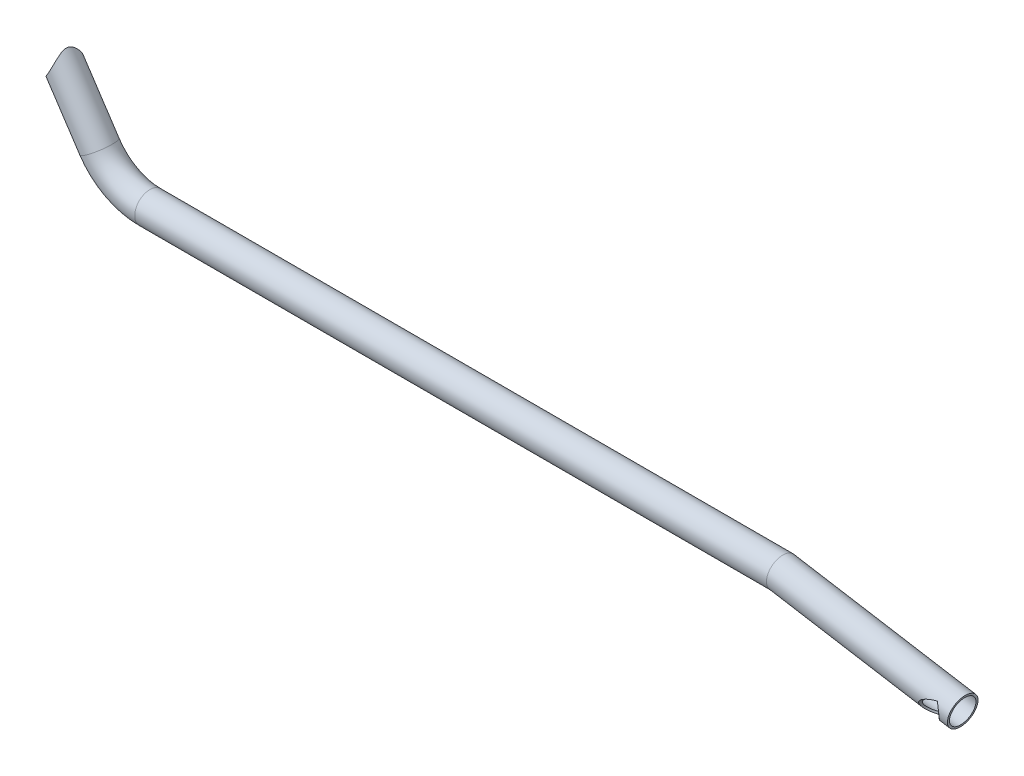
ISO-10303-21;
HEADER;
FILE_DESCRIPTION(('STEP AP214'),'2;1');
FILE_NAME('part.step','',(''),(''),'','','');
FILE_SCHEMA(('AUTOMOTIVE_DESIGN { 1 0 10303 214 1 1 1 1 }'));
ENDSEC;
DATA;
#1=APPLICATION_CONTEXT('core data for automotive mechanical design processes');
#2=APPLICATION_PROTOCOL_DEFINITION('international standard','automotive_design',2000,#1);
#3=PRODUCT_CONTEXT('',#1,'mechanical');
#4=PRODUCT('Part','Part','',(#3));
#5=PRODUCT_RELATED_PRODUCT_CATEGORY('part','',(#4));
#6=PRODUCT_DEFINITION_FORMATION('','',#4);
#7=PRODUCT_DEFINITION_CONTEXT('part definition',#1,'design');
#8=PRODUCT_DEFINITION('design','',#6,#7);
#9=PRODUCT_DEFINITION_SHAPE('','',#8);
#10=(LENGTH_UNIT() NAMED_UNIT(*) SI_UNIT(.MILLI.,.METRE.));
#11=(NAMED_UNIT(*) PLANE_ANGLE_UNIT() SI_UNIT($,.RADIAN.));
#12=(NAMED_UNIT(*) SI_UNIT($,.STERADIAN.) SOLID_ANGLE_UNIT());
#13=UNCERTAINTY_MEASURE_WITH_UNIT(LENGTH_MEASURE(1.E-05),#10,'distance_accuracy_value','');
#14=(GEOMETRIC_REPRESENTATION_CONTEXT(3) GLOBAL_UNCERTAINTY_ASSIGNED_CONTEXT((#13)) GLOBAL_UNIT_ASSIGNED_CONTEXT((#10,
#11,#12)) REPRESENTATION_CONTEXT('',''));
#15=CARTESIAN_POINT('',(0.,0.,0.));
#16=DIRECTION('',(0.,0.,1.));
#17=DIRECTION('',(1.,0.,0.));
#18=AXIS2_PLACEMENT_3D('',#15,#16,#17);
#19=CARTESIAN_POINT('',(-397.791987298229,-68.0982207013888,0.));
#20=DIRECTION('',(-0.551637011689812,0.834084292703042,0.));
#21=DIRECTION('',(-0.834084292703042,-0.551637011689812,0.));
#22=AXIS2_PLACEMENT_3D('',#19,#20,#21);
#23=CYLINDRICAL_SURFACE('',#22,15.);
#24=CARTESIAN_POINT('',(-443.212789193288,-26.613010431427,0.));
#25=CARTESIAN_POINT('',(-443.232089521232,-26.583828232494,0.422309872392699));
#26=CARTESIAN_POINT('',(-443.235515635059,-26.5462966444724,0.84476513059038));
#27=CARTESIAN_POINT('',(-443.211012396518,-26.4540593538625,1.68688016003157));
#28=CARTESIAN_POINT('',(-443.183083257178,-26.3993537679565,2.10653995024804));
#29=CARTESIAN_POINT('',(-443.096697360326,-26.2721403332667,2.93999809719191));
#30=CARTESIAN_POINT('',(-443.03823907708,-26.1996315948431,3.35379615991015));
#31=CARTESIAN_POINT('',(-442.892038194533,-26.0360750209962,4.17245998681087));
#32=CARTESIAN_POINT('',(-442.804295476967,-25.9450271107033,4.57732571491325));
#33=CARTESIAN_POINT('',(-442.601143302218,-25.7435793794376,5.37516655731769));
#34=CARTESIAN_POINT('',(-442.485731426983,-25.6331778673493,5.76814062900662));
#35=CARTESIAN_POINT('',(-442.229219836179,-25.3922127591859,6.53924675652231));
#36=CARTESIAN_POINT('',(-442.088120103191,-25.2616491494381,6.91737880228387));
#37=CARTESIAN_POINT('',(-441.782529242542,-24.979602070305,7.65596536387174));
#38=CARTESIAN_POINT('',(-441.618038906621,-24.8281193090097,8.01642047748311));
#39=CARTESIAN_POINT('',(-441.268241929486,-24.5035927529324,8.71695349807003));
#40=CARTESIAN_POINT('',(-441.082935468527,-24.3305491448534,9.05703158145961));
#41=CARTESIAN_POINT('',(-440.695392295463,-23.9634575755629,9.71246476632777));
#42=CARTESIAN_POINT('',(-440.493252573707,-23.7695282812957,10.0279436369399));
#43=CARTESIAN_POINT('',(-440.074192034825,-23.3597432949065,10.6338590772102));
#44=CARTESIAN_POINT('',(-439.857271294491,-23.143887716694,10.9242957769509));
#45=CARTESIAN_POINT('',(-439.411886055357,-22.6904805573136,11.4779481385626));
#46=CARTESIAN_POINT('',(-439.183424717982,-22.4529349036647,11.7411711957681));
#47=CARTESIAN_POINT('',(-438.718187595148,-21.9566462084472,12.2386908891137));
#48=CARTESIAN_POINT('',(-438.481412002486,-21.6979036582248,12.4729881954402));
#49=CARTESIAN_POINT('',(-438.009145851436,-21.1672387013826,12.9054859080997));
#50=CARTESIAN_POINT('',(-437.773785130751,-20.8958415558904,13.1044733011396));
#51=CARTESIAN_POINT('',(-437.301303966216,-20.3350693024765,13.4727882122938));
#52=CARTESIAN_POINT('',(-437.064183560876,-20.0456945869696,13.6421163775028));
#53=CARTESIAN_POINT('',(-436.591023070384,-19.4504956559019,13.9506354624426));
#54=CARTESIAN_POINT('',(-436.354982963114,-19.1446717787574,14.0898270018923));
#55=CARTESIAN_POINT('',(-435.886580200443,-18.5183308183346,14.3380313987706));
#56=CARTESIAN_POINT('',(-435.654217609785,-18.1978134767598,14.4470437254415));
#57=CARTESIAN_POINT('',(-435.193217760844,-17.5407909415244,14.6361682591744));
#58=CARTESIAN_POINT('',(-434.9646398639,-17.2041592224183,14.7159847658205));
#59=CARTESIAN_POINT('',(-434.515617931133,-16.519952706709,14.8459214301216));
#60=CARTESIAN_POINT('',(-434.295173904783,-16.1723778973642,14.8960415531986));
#61=CARTESIAN_POINT('',(-433.864015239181,-15.4682693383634,14.9676077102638));
#62=CARTESIAN_POINT('',(-433.65330297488,-15.1117334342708,14.9890467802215));
#63=CARTESIAN_POINT('',(-433.242939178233,-14.3917884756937,15.0044487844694));
#64=CARTESIAN_POINT('',(-433.043288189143,-14.0283790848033,14.998410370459));
#65=CARTESIAN_POINT('',(-432.636024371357,-13.2588776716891,14.9582233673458));
#66=CARTESIAN_POINT('',(-432.429710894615,-12.852246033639,14.9212424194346));
#67=CARTESIAN_POINT('',(-432.032506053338,-12.0353193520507,14.8173351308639));
#68=CARTESIAN_POINT('',(-431.84161563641,-11.6250240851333,14.7504069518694));
#69=CARTESIAN_POINT('',(-431.475636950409,-10.8028464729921,14.5884098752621));
#70=CARTESIAN_POINT('',(-431.300552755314,-10.39096374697,14.4933337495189));
#71=CARTESIAN_POINT('',(-430.966319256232,-9.56766764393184,14.2767434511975));
#72=CARTESIAN_POINT('',(-430.807172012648,-9.15625433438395,14.1552258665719));
#73=CARTESIAN_POINT('',(-430.477022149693,-8.26081288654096,13.8627973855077));
#74=CARTESIAN_POINT('',(-430.309161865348,-7.77724414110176,13.6869189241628));
#75=CARTESIAN_POINT('',(-429.994802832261,-6.81620385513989,13.3023722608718));
#76=CARTESIAN_POINT('',(-429.848307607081,-6.33873333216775,13.0936986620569));
#77=CARTESIAN_POINT('',(-429.575433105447,-5.39217532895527,12.6447699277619));
#78=CARTESIAN_POINT('',(-429.449080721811,-4.92309978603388,12.4044733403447));
#79=CARTESIAN_POINT('',(-429.215279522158,-3.99712157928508,11.8933409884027));
#80=CARTESIAN_POINT('',(-429.107827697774,-3.54021698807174,11.6225100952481));
#81=CARTESIAN_POINT('',(-428.921908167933,-2.69664778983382,11.0849294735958));
#82=CARTESIAN_POINT('',(-428.841505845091,-2.30818383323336,10.8216665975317));
#83=CARTESIAN_POINT('',(-428.692141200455,-1.54649211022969,10.2706884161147));
#84=CARTESIAN_POINT('',(-428.623181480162,-1.17326782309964,9.98296757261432));
#85=CARTESIAN_POINT('',(-428.494748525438,-0.447237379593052,9.38232407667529));
#86=CARTESIAN_POINT('',(-428.435255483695,-0.0943896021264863,9.06945616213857));
#87=CARTESIAN_POINT('',(-428.322846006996,0.585490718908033,8.41585406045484));
#88=CARTESIAN_POINT('',(-428.269924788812,0.912541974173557,8.07514044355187));
#89=CARTESIAN_POINT('',(-428.191618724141,1.38305358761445,7.53382293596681));
#90=CARTESIAN_POINT('',(-428.165208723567,1.53928913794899,7.34446081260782));
#91=CARTESIAN_POINT('',(-428.112476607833,1.84049114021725,6.95698596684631));
#92=CARTESIAN_POINT('',(-428.086154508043,1.98545571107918,6.75887179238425));
#93=CARTESIAN_POINT('',(-428.006267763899,2.40002108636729,6.15109157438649));
#94=CARTESIAN_POINT('',(-427.951687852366,2.64991094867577,5.72729854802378));
#95=CARTESIAN_POINT('',(-427.868329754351,2.94882129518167,5.10481683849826));
#96=CARTESIAN_POINT('',(-427.843285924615,3.02946992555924,4.92054057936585));
#97=CARTESIAN_POINT('',(-427.791235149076,3.17620803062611,4.54658049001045));
#98=CARTESIAN_POINT('',(-427.764229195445,3.24230479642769,4.35689942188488));
#99=CARTESIAN_POINT('',(-427.707952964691,3.35824638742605,3.97320923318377));
#100=CARTESIAN_POINT('',(-427.678685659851,3.40811211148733,3.77920602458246));
#101=CARTESIAN_POINT('',(-427.617667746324,3.49037431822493,3.38789201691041));
#102=CARTESIAN_POINT('',(-427.585917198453,3.5227712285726,3.19058129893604));
#103=CARTESIAN_POINT('',(-427.519789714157,3.56939639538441,2.79332184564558));
#104=CARTESIAN_POINT('',(-427.485401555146,3.58354186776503,2.59336521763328));
#105=CARTESIAN_POINT('',(-427.414341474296,3.59328379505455,2.19341705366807));
#106=CARTESIAN_POINT('',(-427.37766956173,3.58888032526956,1.99342551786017));
#107=CARTESIAN_POINT('',(-427.302400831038,3.56212495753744,1.59484775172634));
#108=CARTESIAN_POINT('',(-427.263802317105,3.5397569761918,1.39626294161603));
#109=CARTESIAN_POINT('',(-427.185200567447,3.47824429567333,1.00191975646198));
#110=CARTESIAN_POINT('',(-427.145196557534,3.43909021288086,0.806163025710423));
#111=CARTESIAN_POINT('',(-427.051302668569,3.33046283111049,0.355963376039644));
#112=CARTESIAN_POINT('',(-426.997096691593,3.25528324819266,0.102962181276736));
#113=CARTESIAN_POINT('',(-426.888434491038,3.08220306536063,-0.395120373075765));
#114=CARTESIAN_POINT('',(-426.833978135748,2.98428872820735,-0.640196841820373));
#115=CARTESIAN_POINT('',(-426.725776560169,2.76923074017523,-1.12259421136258));
#116=CARTESIAN_POINT('',(-426.672033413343,2.65204048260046,-1.35989460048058));
#117=CARTESIAN_POINT('',(-426.56628260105,2.4018366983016,-1.8262984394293));
#118=CARTESIAN_POINT('',(-426.514274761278,2.2688247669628,-2.05540271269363));
#119=CARTESIAN_POINT('',(-426.415927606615,1.99848354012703,-2.49159308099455));
#120=CARTESIAN_POINT('',(-426.369438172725,1.86196751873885,-2.69915259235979));
#121=CARTESIAN_POINT('',(-426.279057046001,1.57906497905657,-3.10802596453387));
#122=CARTESIAN_POINT('',(-426.235165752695,1.43267695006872,-3.30933886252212));
#123=CARTESIAN_POINT('',(-426.107941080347,0.980676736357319,-3.90486416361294));
#124=CARTESIAN_POINT('',(-426.029107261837,0.66236756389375,-4.29044470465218));
#125=CARTESIAN_POINT('',(-425.88578279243,-0.000618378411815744,-5.04256749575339));
#126=CARTESIAN_POINT('',(-425.821329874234,-0.345361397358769,-5.40905777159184));
#127=CARTESIAN_POINT('',(-425.708968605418,-1.0551881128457,-6.12425366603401));
#128=CARTESIAN_POINT('',(-425.66105639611,-1.42026704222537,-6.47296341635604));
#129=CARTESIAN_POINT('',(-425.594318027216,-2.06267384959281,-7.05880625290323));
#130=CARTESIAN_POINT('',(-425.571104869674,-2.3359897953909,-7.2998706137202));
#131=CARTESIAN_POINT('',(-425.534732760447,-2.89028540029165,-7.77381999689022));
#132=CARTESIAN_POINT('',(-425.521574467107,-3.17126555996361,-8.00670448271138));
#133=CARTESIAN_POINT('',(-425.498067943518,-4.02460022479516,-8.6934712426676));
#134=CARTESIAN_POINT('',(-425.503700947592,-4.60722924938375,-9.13535857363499));
#135=CARTESIAN_POINT('',(-425.562251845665,-5.79287419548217,-9.98509791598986));
#136=CARTESIAN_POINT('',(-425.61508421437,-6.39585134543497,-10.3930100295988));
#137=CARTESIAN_POINT('',(-425.772718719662,-7.61827310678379,-11.1722626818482));
#138=CARTESIAN_POINT('',(-425.877492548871,-8.23770857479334,-11.5436230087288));
#139=CARTESIAN_POINT('',(-426.103229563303,-9.29755888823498,-12.1375646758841));
#140=CARTESIAN_POINT('',(-426.209546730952,-9.73504708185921,-12.3710149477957));
#141=CARTESIAN_POINT('',(-426.451198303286,-10.6136524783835,-12.8151022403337));
#142=CARTESIAN_POINT('',(-426.5865308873,-11.0547694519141,-13.0257406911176));
#143=CARTESIAN_POINT('',(-426.887398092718,-11.9377305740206,-13.4209401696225));
#144=CARTESIAN_POINT('',(-427.052895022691,-12.3795731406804,-13.605533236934));
#145=CARTESIAN_POINT('',(-427.415224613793,-13.2617067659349,-13.9454400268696));
#146=CARTESIAN_POINT('',(-427.612051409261,-13.701998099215,-14.1007592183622));
#147=CARTESIAN_POINT('',(-427.99811510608,-14.4966765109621,-14.3525711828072));
#148=CARTESIAN_POINT('',(-428.182024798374,-14.8518928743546,-14.4546309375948));
#149=CARTESIAN_POINT('',(-428.570781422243,-15.5569913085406,-14.6345022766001));
#150=CARTESIAN_POINT('',(-428.775626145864,-15.9068739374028,-14.7123164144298));
#151=CARTESIAN_POINT('',(-429.205558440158,-16.5988907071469,-14.8414502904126));
#152=CARTESIAN_POINT('',(-429.43063911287,-16.9410274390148,-14.892779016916));
#153=CARTESIAN_POINT('',(-429.899907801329,-17.6151993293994,-14.9668719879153));
#154=CARTESIAN_POINT('',(-430.144096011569,-17.9472343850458,-14.9896359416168));
#155=CARTESIAN_POINT('',(-430.65134665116,-18.6007029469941,-15.0047966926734));
#156=CARTESIAN_POINT('',(-430.914518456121,-18.9220563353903,-14.997000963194));
#157=CARTESIAN_POINT('',(-431.455844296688,-19.5494155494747,-14.9491444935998));
#158=CARTESIAN_POINT('',(-431.733998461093,-19.8554212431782,-14.9090834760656));
#159=CARTESIAN_POINT('',(-432.302103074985,-20.4497094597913,-14.7957941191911));
#160=CARTESIAN_POINT('',(-432.592050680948,-20.7379962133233,-14.7225737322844));
#161=CARTESIAN_POINT('',(-433.180217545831,-21.2949989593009,-14.5426679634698));
#162=CARTESIAN_POINT('',(-433.478436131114,-21.5637165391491,-14.4359852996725));
#163=CARTESIAN_POINT('',(-434.048225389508,-22.053485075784,-14.2022300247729));
#164=CARTESIAN_POINT('',(-434.319367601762,-22.2765927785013,-14.0784007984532));
#165=CARTESIAN_POINT('',(-434.862325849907,-22.7052950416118,-13.8047281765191));
#166=CARTESIAN_POINT('',(-435.134141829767,-22.9108910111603,-13.654886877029));
#167=CARTESIAN_POINT('',(-435.675641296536,-23.3042830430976,-13.3300912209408));
#168=CARTESIAN_POINT('',(-435.945324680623,-23.492078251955,-13.1551356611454));
#169=CARTESIAN_POINT('',(-436.479832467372,-23.8498718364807,-12.7812521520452));
#170=CARTESIAN_POINT('',(-436.74465666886,-24.0198694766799,-12.5823232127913));
#171=CARTESIAN_POINT('',(-437.271505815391,-24.3451851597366,-12.1580608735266));
#172=CARTESIAN_POINT('',(-437.533397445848,-24.5001887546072,-11.932321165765));
#173=CARTESIAN_POINT('',(-438.046949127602,-24.7924967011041,-11.4588465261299));
#174=CARTESIAN_POINT('',(-438.298609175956,-24.9298010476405,-11.2111115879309));
#175=CARTESIAN_POINT('',(-438.789436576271,-25.1873560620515,-10.695129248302));
#176=CARTESIAN_POINT('',(-439.028600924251,-25.3076026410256,-10.4268769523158));
#177=CARTESIAN_POINT('',(-439.492249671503,-25.5316927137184,-9.87149108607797));
#178=CARTESIAN_POINT('',(-439.716733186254,-25.6355352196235,-9.58435638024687));
#179=CARTESIAN_POINT('',(-440.166554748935,-25.8352823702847,-8.96889073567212));
#180=CARTESIAN_POINT('',(-440.390493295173,-25.9298656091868,-8.63910617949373));
#181=CARTESIAN_POINT('',(-440.816691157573,-26.1015295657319,-7.96146229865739));
#182=CARTESIAN_POINT('',(-441.018949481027,-26.1786094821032,-7.61360214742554));
#183=CARTESIAN_POINT('',(-441.399818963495,-26.3160373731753,-6.90189527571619));
#184=CARTESIAN_POINT('',(-441.578425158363,-26.3763818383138,-6.5380452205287));
#185=CARTESIAN_POINT('',(-441.910178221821,-26.4809473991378,-5.79667596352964));
#186=CARTESIAN_POINT('',(-442.063324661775,-26.5251682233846,-5.4191565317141));
#187=CARTESIAN_POINT('',(-442.349710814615,-26.5997993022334,-4.63344877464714));
#188=CARTESIAN_POINT('',(-442.481556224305,-26.6294001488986,-4.22467411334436));
#189=CARTESIAN_POINT('',(-442.714113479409,-26.6716794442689,-3.39749183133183));
#190=CARTESIAN_POINT('',(-442.814824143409,-26.6843572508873,-2.97908384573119));
#191=CARTESIAN_POINT('',(-442.98412555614,-26.6929121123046,-2.13566856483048));
#192=CARTESIAN_POINT('',(-443.052717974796,-26.6887900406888,-1.71066161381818));
#193=CARTESIAN_POINT('',(-443.157254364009,-26.6636492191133,-0.857152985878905));
#194=CARTESIAN_POINT('',(-443.193199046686,-26.6426308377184,-0.428651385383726));
#195=CARTESIAN_POINT('',(-443.212789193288,-26.613010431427,0.));
#196=B_SPLINE_CURVE_WITH_KNOTS('',3,(#24,#25,#26,#27,#28,#29,#30,#31,#32,#33,#34,#35,#36,#37,
#38,#39,#40,#41,#42,#43,#44,#45,#46,#47,#48,#49,#50,#51,#52,#53,#54,#55,#56,#57,#58,#59,#60,#61,
#62,#63,#64,#65,#66,#67,#68,#69,#70,#71,#72,#73,#74,#75,#76,#77,#78,#79,#80,#81,#82,#83,#84,#85,
#86,#87,#88,#89,#90,#91,#92,#93,#94,#95,#96,#97,#98,#99,#100,#101,#102,#103,#104,#105,#106,#107,
#108,#109,#110,#111,#112,#113,#114,#115,#116,#117,#118,#119,#120,#121,#122,#123,#124,#125,#126,
#127,#128,#129,#130,#131,#132,#133,#134,#135,#136,#137,#138,#139,#140,#141,#142,#143,#144,#145,
#146,#147,#148,#149,#150,#151,#152,#153,#154,#155,#156,#157,#158,#159,#160,#161,#162,#163,#164,
#165,#166,#167,#168,#169,#170,#171,#172,#173,#174,#175,#176,#177,#178,#179,#180,#181,#182,#183,
#184,#185,#186,#187,#188,#189,#190,#191,#192,#193,#194,#195),.UNSPECIFIED.,.T.,.F.,(4,2,2,2,2,2,
2,2,2,2,2,2,2,2,2,2,2,2,2,2,2,2,2,2,2,2,2,2,2,2,2,2,2,2,2,2,2,2,2,2,2,2,2,2,2,2,2,2,2,2,2,2,2,2,
2,2,2,2,2,2,2,2,2,2,2,2,2,2,2,2,2,2,2,2,2,2,2,2,2,2,2,2,2,2,2,4),(0.,1.27088611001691,
2.54176358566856,3.81270458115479,5.08365070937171,6.35470794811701,7.62576604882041,
8.89678113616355,10.167785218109,11.4319149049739,12.696038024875,13.9598167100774,
15.2235661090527,16.4540948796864,17.6845967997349,18.9150734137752,20.1455716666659,
21.3882084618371,22.63084670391,23.8737866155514,25.1167875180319,26.4878671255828,
27.8590309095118,29.2305471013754,30.6022403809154,32.2244261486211,33.8468791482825,
35.4714804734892,37.095822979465,38.5232124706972,39.9509260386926,41.375611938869,
42.7992547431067,43.5395945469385,44.2800576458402,45.7582089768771,46.3658576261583,
46.9732011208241,47.579759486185,48.1863030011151,48.7955880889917,49.4048707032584,
50.0146994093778,50.6248694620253,51.4318924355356,52.2394043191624,53.0488981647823,
53.858310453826,54.6162189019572,55.3742435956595,56.8910818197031,58.411854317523,
59.9322718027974,61.0274936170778,62.1227871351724,64.3138583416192,66.5009673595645,
68.6868857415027,70.2071454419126,71.7273097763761,73.2455874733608,74.7635812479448,
76.0008638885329,77.2380161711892,78.4747483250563,79.7114930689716,80.9560418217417,
82.2006012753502,83.444862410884,84.6890225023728,85.8046988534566,86.920285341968,
88.0359252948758,89.1516113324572,90.2871183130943,91.4226256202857,92.5584046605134,
93.6942520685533,94.9219713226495,96.1497467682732,97.3777794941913,98.605832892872,
99.8958492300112,101.185914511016,102.475912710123,103.76588277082),.UNSPECIFIED.);
#197=CARTESIAN_POINT('',(-443.212789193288,-26.613010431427,0.));
#198=VERTEX_POINT('',#197);
#199=EDGE_CURVE('E154',#198,#198,#196,.T.);
#200=ORIENTED_EDGE('',*,*,#199,.F.);
#201=EDGE_LOOP('',(#200));
#202=FACE_BOUND('',#201,.T.);
#203=CARTESIAN_POINT('',(-397.791987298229,-68.0982207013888,0.));
#204=DIRECTION('',(-0.551637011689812,0.834084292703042,0.));
#205=DIRECTION('',(-0.834084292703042,-0.551637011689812,0.));
#206=AXIS2_PLACEMENT_3D('',#203,#204,#205);
#207=CIRCLE('',#206,15.);
#208=CARTESIAN_POINT('',(-410.303251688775,-76.3727758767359,0.));
#209=VERTEX_POINT('',#208);
#210=EDGE_CURVE('E66',#209,#209,#207,.T.);
#211=ORIENTED_EDGE('',*,*,#210,.T.);
#212=EDGE_LOOP('',(#211));
#213=FACE_BOUND('',#212,.T.);
#214=ADVANCED_FACE('F34',(#202,#213),#23,.T.);
#215=CARTESIAN_POINT('',(-397.791987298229,-68.0982207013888,0.));
#216=DIRECTION('',(-0.551637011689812,0.834084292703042,0.));
#217=DIRECTION('',(-0.834084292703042,-0.551637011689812,0.));
#218=AXIS2_PLACEMENT_3D('',#215,#216,#217);
#219=CYLINDRICAL_SURFACE('',#218,13.);
#220=CARTESIAN_POINT('',(-441.457996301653,-25.6407137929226,0.));
#221=CARTESIAN_POINT('',(-441.476780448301,-25.6123126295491,0.366990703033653));
#222=CARTESIAN_POINT('',(-441.4822815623,-25.5758061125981,0.734025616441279));
#223=CARTESIAN_POINT('',(-441.467018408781,-25.4862979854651,1.4655230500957));
#224=CARTESIAN_POINT('',(-441.446254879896,-25.4332968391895,1.82998564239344));
#225=CARTESIAN_POINT('',(-441.379109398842,-25.3104350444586,2.55363140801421));
#226=CARTESIAN_POINT('',(-441.332730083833,-25.2405761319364,2.91281512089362));
#227=CARTESIAN_POINT('',(-441.215331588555,-25.083566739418,3.62329350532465));
#228=CARTESIAN_POINT('',(-441.144312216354,-24.9964161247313,3.97458811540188));
#229=CARTESIAN_POINT('',(-440.978907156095,-24.8043515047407,4.66675537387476));
#230=CARTESIAN_POINT('',(-440.884516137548,-24.6994334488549,5.00762562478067));
#231=CARTESIAN_POINT('',(-440.673963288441,-24.4714180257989,5.67631409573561));
#232=CARTESIAN_POINT('',(-440.557801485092,-24.3483206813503,6.00413233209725));
#233=CARTESIAN_POINT('',(-440.305567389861,-24.083589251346,6.64424916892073));
#234=CARTESIAN_POINT('',(-440.169495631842,-23.9419556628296,6.95654818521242));
#235=CARTESIAN_POINT('',(-439.879540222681,-23.6399098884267,7.56328803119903));
#236=CARTESIAN_POINT('',(-439.725656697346,-23.4794978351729,7.85772898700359));
#237=CARTESIAN_POINT('',(-439.403251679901,-23.1407334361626,8.42503976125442));
#238=CARTESIAN_POINT('',(-439.234812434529,-22.9624810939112,8.6980160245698));
#239=CARTESIAN_POINT('',(-438.885049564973,-22.5874863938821,9.22214354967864));
#240=CARTESIAN_POINT('',(-438.703726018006,-22.3907441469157,9.47329494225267));
#241=CARTESIAN_POINT('',(-438.330805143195,-21.9792198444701,9.95197843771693));
#242=CARTESIAN_POINT('',(-438.139209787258,-21.7644412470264,10.1795150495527));
#243=CARTESIAN_POINT('',(-437.748357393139,-21.3175041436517,10.60955480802));
#244=CARTESIAN_POINT('',(-437.549100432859,-21.0853458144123,10.8120582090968));
#245=CARTESIAN_POINT('',(-437.148253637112,-20.6078234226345,11.1883717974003));
#246=CARTESIAN_POINT('',(-436.946730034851,-20.3626759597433,11.3625276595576));
#247=CARTESIAN_POINT('',(-436.541272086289,-19.8576043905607,11.6846035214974));
#248=CARTESIAN_POINT('',(-436.337337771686,-19.5976804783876,11.8325238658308));
#249=CARTESIAN_POINT('',(-435.929382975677,-19.0644473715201,12.1017365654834));
#250=CARTESIAN_POINT('',(-435.725362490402,-18.7911374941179,12.2230275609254));
#251=CARTESIAN_POINT('',(-435.319382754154,-18.2327133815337,12.4389185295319));
#252=CARTESIAN_POINT('',(-435.11742355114,-17.9475988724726,12.5335178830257));
#253=CARTESIAN_POINT('',(-434.712489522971,-17.3600269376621,12.6983061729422));
#254=CARTESIAN_POINT('',(-434.509614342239,-17.0573145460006,12.767829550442));
#255=CARTESIAN_POINT('',(-434.109767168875,-16.4431204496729,12.8796789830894));
#256=CARTESIAN_POINT('',(-433.912795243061,-16.1316386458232,12.9220047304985));
#257=CARTESIAN_POINT('',(-433.526146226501,-15.5017103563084,12.9802629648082));
#258=CARTESIAN_POINT('',(-433.336470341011,-15.1832627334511,12.9961911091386));
#259=CARTESIAN_POINT('',(-432.965553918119,-14.5412553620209,13.0025976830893));
#260=CARTESIAN_POINT('',(-432.784313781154,-14.2176953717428,12.9930749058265));
#261=CARTESIAN_POINT('',(-432.41300679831,-13.5338939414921,12.9473907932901));
#262=CARTESIAN_POINT('',(-432.22393491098,-13.1732873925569,12.9086029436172));
#263=CARTESIAN_POINT('',(-431.85776161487,-12.4501639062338,12.8027771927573));
#264=CARTESIAN_POINT('',(-431.680660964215,-12.0876468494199,12.7357375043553));
#265=CARTESIAN_POINT('',(-431.338687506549,-11.3625233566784,12.5747061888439));
#266=CARTESIAN_POINT('',(-431.173823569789,-10.9999170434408,12.4806952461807));
#267=CARTESIAN_POINT('',(-430.856534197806,-10.2768368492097,12.266953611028));
#268=CARTESIAN_POINT('',(-430.70411007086,-9.91636319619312,12.1472202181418));
#269=CARTESIAN_POINT('',(-430.388764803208,-9.14369096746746,11.862484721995));
#270=CARTESIAN_POINT('',(-430.227902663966,-8.73217472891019,11.693337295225));
#271=CARTESIAN_POINT('',(-429.921944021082,-7.91761726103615,11.323176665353));
#272=CARTESIAN_POINT('',(-429.776850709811,-7.51457776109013,11.1221570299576));
#273=CARTESIAN_POINT('',(-429.501456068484,-6.72033029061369,10.6888350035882));
#274=CARTESIAN_POINT('',(-429.371157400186,-6.32912445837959,10.4565269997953));
#275=CARTESIAN_POINT('',(-429.124087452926,-5.5626394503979,9.96067584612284));
#276=CARTESIAN_POINT('',(-429.007311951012,-5.18735532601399,9.69714249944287));
#277=CARTESIAN_POINT('',(-428.816114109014,-4.55825180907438,9.21515889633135));
#278=CARTESIAN_POINT('',(-428.738887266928,-4.29945499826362,9.00429279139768));
#279=CARTESIAN_POINT('',(-428.589814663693,-3.79525465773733,8.56526575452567));
#280=CARTESIAN_POINT('',(-428.517969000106,-3.54985137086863,8.33710450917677));
#281=CARTESIAN_POINT('',(-428.378846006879,-3.07587526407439,7.86320919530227));
#282=CARTESIAN_POINT('',(-428.311562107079,-2.84727819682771,7.6175014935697));
#283=CARTESIAN_POINT('',(-428.180447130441,-2.41058615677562,7.10782461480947));
#284=CARTESIAN_POINT('',(-428.116614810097,-2.20248377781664,6.84386209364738));
#285=CARTESIAN_POINT('',(-427.965645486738,-1.73189788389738,6.1856172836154));
#286=CARTESIAN_POINT('',(-427.879580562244,-1.4816862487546,5.78197080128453));
#287=CARTESIAN_POINT('',(-427.75159993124,-1.15711972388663,5.15066209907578));
#288=CARTESIAN_POINT('',(-427.709134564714,-1.05740483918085,4.93596671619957));
#289=CARTESIAN_POINT('',(-427.624235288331,-0.87712554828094,4.49872213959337));
#290=CARTESIAN_POINT('',(-427.581801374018,-0.796550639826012,4.27617733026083));
#291=CARTESIAN_POINT('',(-427.49625173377,-0.655834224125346,3.82180927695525));
#292=CARTESIAN_POINT('',(-427.453133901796,-0.595947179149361,3.58990715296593));
#293=CARTESIAN_POINT('',(-427.366688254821,-0.499689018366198,3.12128775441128));
#294=CARTESIAN_POINT('',(-427.323360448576,-0.463316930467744,2.88457067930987));
#295=CARTESIAN_POINT('',(-427.236678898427,-0.415012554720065,2.40873318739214));
#296=CARTESIAN_POINT('',(-427.193325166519,-0.403072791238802,2.16961352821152));
#297=CARTESIAN_POINT('',(-427.106932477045,-0.403512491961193,1.69136230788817));
#298=CARTESIAN_POINT('',(-427.063893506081,-0.415890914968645,1.45223074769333));
#299=CARTESIAN_POINT('',(-426.98494300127,-0.460315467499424,1.01153792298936));
#300=CARTESIAN_POINT('',(-426.948921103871,-0.489172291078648,0.809664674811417));
#301=CARTESIAN_POINT('',(-426.877778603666,-0.562631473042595,0.408615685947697));
#302=CARTESIAN_POINT('',(-426.842658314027,-0.607239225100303,0.209440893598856));
#303=CARTESIAN_POINT('',(-426.739146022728,-0.762775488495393,-0.382755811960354));
#304=CARTESIAN_POINT('',(-426.672589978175,-0.895424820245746,-0.770519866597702));
#305=CARTESIAN_POINT('',(-426.556966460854,-1.18225461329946,-1.46714086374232));
#306=CARTESIAN_POINT('',(-426.506802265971,-1.32963472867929,-1.77872463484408));
#307=CARTESIAN_POINT('',(-426.412839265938,-1.65132190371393,-2.38885454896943));
#308=CARTESIAN_POINT('',(-426.369044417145,-1.82564556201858,-2.68739250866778));
#309=CARTESIAN_POINT('',(-426.288712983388,-2.19675692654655,-3.2723045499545));
#310=CARTESIAN_POINT('',(-426.252198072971,-2.39360904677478,-3.55864036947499));
#311=CARTESIAN_POINT('',(-426.187398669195,-2.80544224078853,-4.11880897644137));
#312=CARTESIAN_POINT('',(-426.159113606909,-3.0204220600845,-4.39264262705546));
#313=CARTESIAN_POINT('',(-426.097829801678,-3.59310741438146,-5.0821940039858));
#314=CARTESIAN_POINT('',(-426.071424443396,-3.96198254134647,-5.48925711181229));
#315=CARTESIAN_POINT('',(-426.043262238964,-4.7285702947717,-6.27630677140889));
#316=CARTESIAN_POINT('',(-426.041518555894,-5.12629820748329,-6.65627875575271));
#317=CARTESIAN_POINT('',(-426.065087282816,-5.94496438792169,-7.39034264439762));
#318=CARTESIAN_POINT('',(-426.090428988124,-6.36592731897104,-7.74440608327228));
#319=CARTESIAN_POINT('',(-426.170580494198,-7.22602543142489,-8.42595610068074));
#320=CARTESIAN_POINT('',(-426.225384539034,-7.6651570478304,-8.75344785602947));
#321=CARTESIAN_POINT('',(-426.368503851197,-8.56830124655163,-9.38798034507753));
#322=CARTESIAN_POINT('',(-426.457567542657,-9.03265477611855,-9.69436981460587));
#323=CARTESIAN_POINT('',(-426.671622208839,-9.97285420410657,-10.2756315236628));
#324=CARTESIAN_POINT('',(-426.796619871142,-10.4487022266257,-10.550497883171));
#325=CARTESIAN_POINT('',(-427.084615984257,-11.4067542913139,-11.0643280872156));
#326=CARTESIAN_POINT('',(-427.247512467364,-11.8889380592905,-11.3033854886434));
#327=CARTESIAN_POINT('',(-427.521787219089,-12.6141587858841,-11.6318925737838));
#328=CARTESIAN_POINT('',(-427.618182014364,-12.8561829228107,-11.7363669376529));
#329=CARTESIAN_POINT('',(-427.821165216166,-13.3404154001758,-11.9346693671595));
#330=CARTESIAN_POINT('',(-427.92775590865,-13.5826237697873,-12.0284950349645));
#331=CARTESIAN_POINT('',(-428.189193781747,-14.1486923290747,-12.2346602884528));
#332=CARTESIAN_POINT('',(-428.34813354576,-14.4723397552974,-12.3424619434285));
#333=CARTESIAN_POINT('',(-428.684417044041,-15.1166755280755,-12.5355864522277));
#334=CARTESIAN_POINT('',(-428.861755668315,-15.4373646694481,-12.6209155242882));
#335=CARTESIAN_POINT('',(-429.23442114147,-16.0737049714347,-12.7671069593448));
#336=CARTESIAN_POINT('',(-429.429740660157,-16.3893581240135,-12.8279792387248));
#337=CARTESIAN_POINT('',(-429.837581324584,-17.0135192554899,-12.9233346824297));
#338=CARTESIAN_POINT('',(-430.05010300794,-17.3220270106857,-12.9578170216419));
#339=CARTESIAN_POINT('',(-430.492531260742,-17.9316950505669,-12.998719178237));
#340=CARTESIAN_POINT('',(-430.72255151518,-18.2327868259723,-13.0049360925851));
#341=CARTESIAN_POINT('',(-431.19660319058,-18.8228524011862,-12.9872006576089));
#342=CARTESIAN_POINT('',(-431.440634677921,-19.1118261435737,-12.9632481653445));
#343=CARTESIAN_POINT('',(-431.940009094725,-19.6751978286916,-12.8840773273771));
#344=CARTESIAN_POINT('',(-432.19534795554,-19.9496009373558,-12.8288701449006));
#345=CARTESIAN_POINT('',(-432.714296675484,-20.4818192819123,-12.6866302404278));
#346=CARTESIAN_POINT('',(-432.977905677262,-20.7396362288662,-12.5996008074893));
#347=CARTESIAN_POINT('',(-433.480245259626,-21.209227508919,-12.4052388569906));
#348=CARTESIAN_POINT('',(-433.718474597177,-21.422931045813,-12.3012496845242));
#349=CARTESIAN_POINT('',(-434.196134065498,-21.8349740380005,-12.0685892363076));
#350=CARTESIAN_POINT('',(-434.43556409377,-22.0333147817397,-11.9399200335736));
#351=CARTESIAN_POINT('',(-434.913018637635,-22.4140218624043,-11.6586217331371));
#352=CARTESIAN_POINT('',(-435.151043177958,-22.5963884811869,-11.5059930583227));
#353=CARTESIAN_POINT('',(-435.623135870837,-22.9448335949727,-11.1777594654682));
#354=CARTESIAN_POINT('',(-435.857203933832,-23.1109117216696,-11.0021540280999));
#355=CARTESIAN_POINT('',(-436.31567679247,-23.4244849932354,-10.6317889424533));
#356=CARTESIAN_POINT('',(-436.540171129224,-23.5722083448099,-10.4373329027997));
#357=CARTESIAN_POINT('',(-436.980706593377,-23.8518763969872,-10.0285455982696));
#358=CARTESIAN_POINT('',(-437.196747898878,-23.9838214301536,-9.8142147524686));
#359=CARTESIAN_POINT('',(-437.618358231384,-24.2322252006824,-9.36703303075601));
#360=CARTESIAN_POINT('',(-437.823925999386,-24.3486820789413,-9.13417993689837));
#361=CARTESIAN_POINT('',(-438.22268867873,-24.5664631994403,-8.65142109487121));
#362=CARTESIAN_POINT('',(-438.415882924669,-24.6677866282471,-8.40151443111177));
#363=CARTESIAN_POINT('',(-438.799394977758,-24.8613723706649,-7.87062559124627));
#364=CARTESIAN_POINT('',(-438.988838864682,-24.9527215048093,-7.58867831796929));
#365=CARTESIAN_POINT('',(-439.350043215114,-25.1193704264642,-7.00915070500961));
#366=CARTESIAN_POINT('',(-439.521803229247,-25.1946698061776,-6.71156996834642));
#367=CARTESIAN_POINT('',(-439.846064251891,-25.3297103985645,-6.1025694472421));
#368=CARTESIAN_POINT('',(-439.998558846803,-25.3894464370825,-5.7911451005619));
#369=CARTESIAN_POINT('',(-440.282807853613,-25.4937324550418,-5.15650377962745));
#370=CARTESIAN_POINT('',(-440.414561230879,-25.5382816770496,-4.83328621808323));
#371=CARTESIAN_POINT('',(-440.667681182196,-25.6160585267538,-4.14568925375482));
#372=CARTESIAN_POINT('',(-440.786850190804,-25.6477964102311,-3.78032903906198));
#373=CARTESIAN_POINT('',(-440.997599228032,-25.6936919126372,-3.04063525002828));
#374=CARTESIAN_POINT('',(-441.089177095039,-25.7078481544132,-2.66630097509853));
#375=CARTESIAN_POINT('',(-441.243860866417,-25.7186904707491,-1.91153889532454));
#376=CARTESIAN_POINT('',(-441.306966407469,-25.7153763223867,-1.5311110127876));
#377=CARTESIAN_POINT('',(-441.404216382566,-25.691230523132,-0.767138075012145));
#378=CARTESIAN_POINT('',(-441.438362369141,-25.6703998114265,-0.38359318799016));
#379=CARTESIAN_POINT('',(-441.457996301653,-25.6407137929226,0.));
#380=B_SPLINE_CURVE_WITH_KNOTS('',3,(#220,#221,#222,#223,#224,#225,#226,#227,#228,#229,#230,
#231,#232,#233,#234,#235,#236,#237,#238,#239,#240,#241,#242,#243,#244,#245,#246,#247,#248,#249,
#250,#251,#252,#253,#254,#255,#256,#257,#258,#259,#260,#261,#262,#263,#264,#265,#266,#267,#268,
#269,#270,#271,#272,#273,#274,#275,#276,#277,#278,#279,#280,#281,#282,#283,#284,#285,#286,#287,
#288,#289,#290,#291,#292,#293,#294,#295,#296,#297,#298,#299,#300,#301,#302,#303,#304,#305,#306,
#307,#308,#309,#310,#311,#312,#313,#314,#315,#316,#317,#318,#319,#320,#321,#322,#323,#324,#325,
#326,#327,#328,#329,#330,#331,#332,#333,#334,#335,#336,#337,#338,#339,#340,#341,#342,#343,#344,
#345,#346,#347,#348,#349,#350,#351,#352,#353,#354,#355,#356,#357,#358,#359,#360,#361,#362,#363,
#364,#365,#366,#367,#368,#369,#370,#371,#372,#373,#374,#375,#376,#377,#378,#379),.UNSPECIFIED.,
.T.,.F.,(4,2,2,2,2,2,2,2,2,2,2,2,2,2,2,2,2,2,2,2,2,2,2,2,2,2,2,2,2,2,2,2,2,2,2,2,2,2,2,2,2,2,2,
2,2,2,2,2,2,2,2,2,2,2,2,2,2,2,2,2,2,2,2,2,2,2,2,2,2,2,2,2,2,2,2,2,2,2,2,4),(0.,1.10535879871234,
2.21068651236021,3.31590045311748,4.42112300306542,5.52659785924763,6.6320713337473,
7.73751517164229,8.84295120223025,9.94250512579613,11.0420524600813,12.1413894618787,
13.2407152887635,14.3254259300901,15.4101223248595,16.4948740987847,17.5796510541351,
18.6914049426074,19.8031714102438,20.9151207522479,22.0271228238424,23.2529299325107,
24.4788145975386,25.7055793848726,26.9324730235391,28.3503357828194,29.7684850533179,
31.1868890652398,32.6048489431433,33.6321283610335,34.6594263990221,35.68521196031,
36.7106254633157,38.1527847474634,38.8735645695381,39.5939479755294,40.3229005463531,
41.0518229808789,41.7805223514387,42.5091905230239,43.1297863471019,43.7505948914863,
44.9919999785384,46.0355662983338,47.0797780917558,48.1270538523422,49.1742571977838,
50.8217921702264,52.4702064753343,54.1204054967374,55.7702822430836,57.4584607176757,
59.146953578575,60.83095499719,61.6726766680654,62.5145875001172,63.6424953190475,
64.7700907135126,65.8972284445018,67.0244014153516,68.1596531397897,69.294910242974,
70.4297621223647,71.5644967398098,72.5727776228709,73.5809738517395,74.5891522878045,
75.5973535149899,76.5913967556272,77.5854190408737,78.5795605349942,79.5737554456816,
80.6278242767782,81.6819198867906,82.7363654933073,83.7908636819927,84.9461851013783,
86.1015970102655,87.2570236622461,88.4123883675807),.UNSPECIFIED.);
#381=CARTESIAN_POINT('',(-441.457996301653,-25.6407137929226,0.));
#382=VERTEX_POINT('',#381);
#383=EDGE_CURVE('E38',#382,#382,#380,.T.);
#384=ORIENTED_EDGE('',*,*,#383,.T.);
#385=EDGE_LOOP('',(#384));
#386=FACE_BOUND('',#385,.T.);
#387=CARTESIAN_POINT('',(-397.791987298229,-68.0982207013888,0.));
#388=DIRECTION('',(-0.551637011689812,0.834084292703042,0.));
#389=DIRECTION('',(-0.834084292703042,-0.551637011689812,0.));
#390=AXIS2_PLACEMENT_3D('',#387,#388,#389);
#391=CIRCLE('',#390,13.);
#392=CARTESIAN_POINT('',(-408.635083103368,-75.2695018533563,0.));
#393=VERTEX_POINT('',#392);
#394=EDGE_CURVE('E100',#393,#393,#391,.T.);
#395=ORIENTED_EDGE('',*,*,#394,.F.);
#396=EDGE_LOOP('',(#395));
#397=FACE_BOUND('',#396,.T.);
#398=ADVANCED_FACE('F139',(#386,#397),#219,.F.);
#399=CARTESIAN_POINT('',(-347.746929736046,-35.,0.));
#400=DIRECTION('',(0.,0.,-1.));
#401=DIRECTION('',(-1.,0.,0.));
#402=AXIS2_PLACEMENT_3D('',#399,#400,#401);
#403=TOROIDAL_SURFACE('',#402,60.,15.);
#404=CARTESIAN_POINT('',(-347.746929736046,-95.,0.));
#405=DIRECTION('',(-1.,0.,0.));
#406=DIRECTION('',(0.,-1.,0.));
#407=AXIS2_PLACEMENT_3D('',#404,#405,#406);
#408=CIRCLE('',#407,15.);
#409=CARTESIAN_POINT('',(-347.746929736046,-110.,0.));
#410=VERTEX_POINT('',#409);
#411=EDGE_CURVE('E99',#410,#410,#408,.T.);
#412=CARTESIAN_POINT('',(-347.746929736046,-35.,0.));
#413=DIRECTION('',(0.,0.,-1.));
#414=DIRECTION('',(-1.,0.,0.));
#415=AXIS2_PLACEMENT_3D('',#412,#413,#414);
#416=CIRCLE('',#415,75.);
#417=EDGE_CURVE('',#410,#209,#416,.T.);
#418=ORIENTED_EDGE('',*,*,#411,.T.);
#419=ORIENTED_EDGE('',*,*,#210,.F.);
#420=ORIENTED_EDGE('',*,*,#417,.T.);
#421=ORIENTED_EDGE('',*,*,#417,.F.);
#422=EDGE_LOOP('',(#418,#420,#419,#421));
#423=FACE_BOUND('',#422,.T.);
#424=ADVANCED_FACE('F136',(#423),#403,.T.);
#425=CARTESIAN_POINT('',(-347.746929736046,-35.,0.));
#426=DIRECTION('',(0.,0.,-1.));
#427=DIRECTION('',(-1.,0.,0.));
#428=AXIS2_PLACEMENT_3D('',#425,#426,#427);
#429=TOROIDAL_SURFACE('',#428,60.,13.);
#430=CARTESIAN_POINT('',(-347.746929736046,-95.,0.));
#431=DIRECTION('',(-1.,0.,0.));
#432=DIRECTION('',(0.,-1.,0.));
#433=AXIS2_PLACEMENT_3D('',#430,#431,#432);
#434=CIRCLE('',#433,13.);
#435=CARTESIAN_POINT('',(-347.746929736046,-108.,0.));
#436=VERTEX_POINT('',#435);
#437=EDGE_CURVE('E91',#436,#436,#434,.T.);
#438=CARTESIAN_POINT('',(-347.746929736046,-35.,0.));
#439=DIRECTION('',(0.,0.,-1.));
#440=DIRECTION('',(-1.,0.,0.));
#441=AXIS2_PLACEMENT_3D('',#438,#439,#440);
#442=CIRCLE('',#441,73.);
#443=EDGE_CURVE('',#436,#393,#442,.T.);
#444=ORIENTED_EDGE('',*,*,#437,.F.);
#445=ORIENTED_EDGE('',*,*,#394,.T.);
#446=ORIENTED_EDGE('',*,*,#443,.T.);
#447=ORIENTED_EDGE('',*,*,#443,.F.);
#448=EDGE_LOOP('',(#444,#446,#445,#447));
#449=FACE_BOUND('',#448,.T.);
#450=ADVANCED_FACE('F130',(#449),#429,.F.);
#451=CARTESIAN_POINT('',(280.,-95.,0.));
#452=DIRECTION('',(-1.,0.,0.));
#453=DIRECTION('',(0.,-1.,0.));
#454=AXIS2_PLACEMENT_3D('',#451,#452,#453);
#455=CYLINDRICAL_SURFACE('',#454,15.);
#456=CARTESIAN_POINT('',(280.,-95.,0.));
#457=DIRECTION('',(-0.996592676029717,0.0824805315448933,0.));
#458=DIRECTION('',(-0.0824805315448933,-0.996592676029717,0.));
#459=AXIS2_PLACEMENT_3D('',#456,#457,#458);
#460=ELLIPSE('',#459,15.0512846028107,15.);
#461=CARTESIAN_POINT('',(278.758562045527,-110.,0.));
#462=VERTEX_POINT('',#461);
#463=EDGE_CURVE('E86',#462,#462,#460,.F.);
#464=ORIENTED_EDGE('',*,*,#463,.F.);
#465=EDGE_LOOP('',(#464));
#466=FACE_BOUND('',#465,.T.);
#467=ORIENTED_EDGE('',*,*,#411,.F.);
#468=EDGE_LOOP('',(#467));
#469=FACE_BOUND('',#468,.T.);
#470=ADVANCED_FACE('F127',(#466,#469),#455,.T.);
#471=CARTESIAN_POINT('',(280.,-95.,0.));
#472=DIRECTION('',(-1.,0.,0.));
#473=DIRECTION('',(0.,-1.,0.));
#474=AXIS2_PLACEMENT_3D('',#471,#472,#473);
#475=CYLINDRICAL_SURFACE('',#474,13.);
#476=CARTESIAN_POINT('',(280.,-95.,0.));
#477=DIRECTION('',(-0.996592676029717,0.0824805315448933,0.));
#478=DIRECTION('',(-0.0824805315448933,-0.996592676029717,0.));
#479=AXIS2_PLACEMENT_3D('',#476,#477,#478);
#480=ELLIPSE('',#479,13.0444466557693,13.);
#481=CARTESIAN_POINT('',(278.924087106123,-108.,0.));
#482=VERTEX_POINT('',#481);
#483=EDGE_CURVE('E88',#482,#482,#480,.F.);
#484=ORIENTED_EDGE('',*,*,#483,.T.);
#485=EDGE_LOOP('',(#484));
#486=FACE_BOUND('',#485,.T.);
#487=ORIENTED_EDGE('',*,*,#437,.T.);
#488=EDGE_LOOP('',(#487));
#489=FACE_BOUND('',#488,.T.);
#490=ADVANCED_FACE('F125',(#486,#489),#475,.F.);
#491=CARTESIAN_POINT('',(238.150850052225,-88.0251416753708,0.));
#492=DIRECTION('',(0.986393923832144,-0.164398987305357,0.));
#493=DIRECTION('',(0.164398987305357,0.986393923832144,0.));
#494=AXIS2_PLACEMENT_3D('',#491,#492,#493);
#495=CYLINDRICAL_SURFACE('',#494,13.);
#496=CARTESIAN_POINT('',(433.491839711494,-120.581973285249,0.));
#497=DIRECTION('',(-0.653897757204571,-0.0882746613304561,0.751415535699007));
#498=DIRECTION('',(0.739654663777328,-0.283503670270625,0.6103578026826));
#499=AXIS2_PLACEMENT_3D('',#496,#497,#498);
#500=ELLIPSE('',#499,20.6189324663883,13.);
#501=CARTESIAN_POINT('',(445.91196789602,-116.181257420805,11.3252458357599));
#502=VERTEX_POINT('',#501);
#503=CARTESIAN_POINT('',(438.572671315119,-134.296462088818,2.81029927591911));
#504=VERTEX_POINT('',#503);
#505=EDGE_CURVE('E73',#502,#504,#500,.F.);
#506=ORIENTED_EDGE('',*,*,#505,.F.);
#507=CARTESIAN_POINT('',(445.91196789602,-116.181257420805,11.3252458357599));
#508=CARTESIAN_POINT('',(445.574605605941,-116.254712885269,11.3973284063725));
#509=CARTESIAN_POINT('',(445.238107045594,-116.332631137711,11.4689751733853));
#510=CARTESIAN_POINT('',(444.567003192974,-116.49775579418,11.6106996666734));
#511=CARTESIAN_POINT('',(444.23239823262,-116.584963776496,11.6807771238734));
#512=CARTESIAN_POINT('',(443.564103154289,-116.769353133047,11.8189008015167));
#513=CARTESIAN_POINT('',(443.230421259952,-116.866570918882,11.8869383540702));
#514=CARTESIAN_POINT('',(442.565593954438,-117.071198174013,12.019956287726));
#515=CARTESIAN_POINT('',(442.234448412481,-117.178607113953,12.0849368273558));
#516=CARTESIAN_POINT('',(441.571402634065,-117.405504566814,12.2117525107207));
#517=CARTESIAN_POINT('',(441.239535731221,-117.525115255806,12.2735441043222));
#518=CARTESIAN_POINT('',(440.579431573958,-117.776169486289,12.39226218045));
#519=CARTESIAN_POINT('',(440.251194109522,-117.907612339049,12.4491889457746));
#520=CARTESIAN_POINT('',(439.599603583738,-118.183080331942,12.5570452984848));
#521=CARTESIAN_POINT('',(439.27624404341,-118.327086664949,12.6079835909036));
#522=CARTESIAN_POINT('',(438.635031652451,-118.628944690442,12.702714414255));
#523=CARTESIAN_POINT('',(438.317177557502,-118.786793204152,12.7465085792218));
#524=CARTESIAN_POINT('',(437.759143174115,-119.08043727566,12.8165789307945));
#525=CARTESIAN_POINT('',(437.517583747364,-119.213199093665,12.8445793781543));
#526=CARTESIAN_POINT('',(437.03946297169,-119.488566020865,12.8945673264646));
#527=CARTESIAN_POINT('',(436.802901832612,-119.631171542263,12.9165545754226));
#528=CARTESIAN_POINT('',(436.335886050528,-119.927011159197,12.9535396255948));
#529=CARTESIAN_POINT('',(436.105432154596,-120.080246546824,12.9685365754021));
#530=CARTESIAN_POINT('',(435.652110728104,-120.398156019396,12.9903805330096));
#531=CARTESIAN_POINT('',(435.429243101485,-120.562829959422,12.9972276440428));
#532=CARTESIAN_POINT('',(434.990076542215,-120.906707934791,13.0014384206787));
#533=CARTESIAN_POINT('',(434.773903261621,-121.086075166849,12.998675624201));
#534=CARTESIAN_POINT('',(434.353724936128,-121.458226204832,12.9817342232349));
#535=CARTESIAN_POINT('',(434.149722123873,-121.651012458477,12.9675535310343));
#536=CARTESIAN_POINT('',(433.757698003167,-122.049900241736,12.925973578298));
#537=CARTESIAN_POINT('',(433.569632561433,-122.255962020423,12.8986123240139));
#538=CARTESIAN_POINT('',(433.212847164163,-122.681784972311,12.8287269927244));
#539=CARTESIAN_POINT('',(433.044113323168,-122.90153613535,12.7862138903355));
#540=CARTESIAN_POINT('',(432.787783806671,-123.271141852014,12.7028494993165));
#541=CARTESIAN_POINT('',(432.693057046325,-123.417222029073,12.6670587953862));
#542=CARTESIAN_POINT('',(432.514441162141,-123.713970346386,12.5882694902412));
#543=CARTESIAN_POINT('',(432.430548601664,-123.864637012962,12.5452731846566));
#544=CARTESIAN_POINT('',(432.274819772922,-124.16972851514,12.451850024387));
#545=CARTESIAN_POINT('',(432.202975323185,-124.324150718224,12.4014282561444));
#546=CARTESIAN_POINT('',(432.072314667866,-124.635862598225,12.2930593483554));
#547=CARTESIAN_POINT('',(432.013498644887,-124.793152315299,12.2351121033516));
#548=CARTESIAN_POINT('',(431.909468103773,-125.110085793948,12.111563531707));
#549=CARTESIAN_POINT('',(431.864313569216,-125.269736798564,12.04593015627));
#550=CARTESIAN_POINT('',(431.788407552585,-125.589389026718,11.9075720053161));
#551=CARTESIAN_POINT('',(431.757656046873,-125.749390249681,11.8348472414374));
#552=CARTESIAN_POINT('',(431.710600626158,-126.068463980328,11.6828281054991));
#553=CARTESIAN_POINT('',(431.694302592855,-126.227536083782,11.6035310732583));
#554=CARTESIAN_POINT('',(431.675834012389,-126.543442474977,11.4390835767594));
#555=CARTESIAN_POINT('',(431.673663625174,-126.700276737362,11.3539330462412));
#556=CARTESIAN_POINT('',(431.682565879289,-127.003423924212,11.1826201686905));
#557=CARTESIAN_POINT('',(431.693026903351,-127.149886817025,11.0966893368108));
#558=CARTESIAN_POINT('',(431.725390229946,-127.439132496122,10.9208400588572));
#559=CARTESIAN_POINT('',(431.747296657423,-127.581913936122,10.8309201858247));
#560=CARTESIAN_POINT('',(431.828851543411,-128.00382738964,10.5561639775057));
#561=CARTESIAN_POINT('',(431.904342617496,-128.276701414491,10.3662326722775));
#562=CARTESIAN_POINT('',(432.07611629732,-128.763888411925,10.0062739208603));
#563=CARTESIAN_POINT('',(432.167643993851,-128.98087885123,9.83748137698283));
#564=CARTESIAN_POINT('',(432.371572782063,-129.400930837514,9.49502195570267));
#565=CARTESIAN_POINT('',(432.483986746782,-129.603983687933,9.32135212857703));
#566=CARTESIAN_POINT('',(432.726316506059,-129.996894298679,8.97011091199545));
#567=CARTESIAN_POINT('',(432.856281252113,-130.186712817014,8.79252981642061));
#568=CARTESIAN_POINT('',(433.130467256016,-130.553242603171,8.43479807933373));
#569=CARTESIAN_POINT('',(433.274694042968,-130.729948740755,8.25464646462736));
#570=CARTESIAN_POINT('',(433.690598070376,-131.202439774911,7.75277150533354));
#571=CARTESIAN_POINT('',(433.974818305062,-131.485014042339,7.42896719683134));
#572=CARTESIAN_POINT('',(434.569720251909,-132.01534130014,6.77703260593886));
#573=CARTESIAN_POINT('',(434.880424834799,-132.26306369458,6.44889879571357));
#574=CARTESIAN_POINT('',(435.521162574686,-132.72685970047,5.78879185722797));
#575=CARTESIAN_POINT('',(435.851208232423,-132.942912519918,5.45681635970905));
#576=CARTESIAN_POINT('',(436.524946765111,-133.345377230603,4.78925838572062));
#577=CARTESIAN_POINT('',(436.868632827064,-133.531803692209,4.45367776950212));
#578=CARTESIAN_POINT('',(437.440129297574,-133.814458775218,3.89984903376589));
#579=CARTESIAN_POINT('',(437.66510380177,-133.918994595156,3.68286136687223));
#580=CARTESIAN_POINT('',(438.117257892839,-134.116333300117,3.24771207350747));
#581=CARTESIAN_POINT('',(438.344426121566,-134.209178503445,3.02955784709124));
#582=CARTESIAN_POINT('',(438.572671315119,-134.296462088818,2.81029927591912));
#583=B_SPLINE_CURVE_WITH_KNOTS('',3,(#507,#508,#509,#510,#511,#512,#513,#514,#515,#516,#517,
#518,#519,#520,#521,#522,#523,#524,#525,#526,#527,#528,#529,#530,#531,#532,#533,#534,#535,#536,
#537,#538,#539,#540,#541,#542,#543,#544,#545,#546,#547,#548,#549,#550,#551,#552,#553,#554,#555,
#556,#557,#558,#559,#560,#561,#562,#563,#564,#565,#566,#567,#568,#569,#570,#571,#572,#573,#574,
#575,#576,#577,#578,#579,#580,#581,#582),.UNSPECIFIED.,.F.,.F.,(4,2,2,2,2,2,2,2,2,2,2,2,2,2,2,2,
2,2,2,2,2,2,2,2,2,2,2,2,2,2,2,2,2,2,2,2,2,4),(0.,1.05812393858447,2.11642793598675,
3.17872757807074,4.24097207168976,5.31515305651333,6.38927155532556,7.46180885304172,
8.53410049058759,9.36502640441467,10.1959871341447,11.027049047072,11.8581004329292,
12.7001292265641,13.5423120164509,14.3820807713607,15.2212425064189,15.7540148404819,
16.2866177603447,16.8188575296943,17.3511047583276,17.8856561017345,18.4202065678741,
18.9549744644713,19.4897484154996,19.9996344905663,20.5097044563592,21.5292527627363,
22.3973363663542,23.2659567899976,24.1370519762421,25.0084862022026,26.5516767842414,
28.0962137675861,29.6417602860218,31.1865443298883,32.1750954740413,33.1599585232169),.UNSPECIFIED.);
#584=EDGE_CURVE('E71',#502,#504,#583,.T.);
#585=ORIENTED_EDGE('',*,*,#584,.T.);
#586=EDGE_LOOP('',(#506,#585));
#587=FACE_BOUND('',#586,.T.);
#588=CARTESIAN_POINT('',(460.,-125.,0.));
#589=DIRECTION('',(0.986393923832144,-0.164398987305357,0.));
#590=DIRECTION('',(0.164398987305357,0.986393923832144,0.));
#591=AXIS2_PLACEMENT_3D('',#588,#589,#590);
#592=CIRCLE('',#591,13.);
#593=CARTESIAN_POINT('',(462.13718683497,-112.176878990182,0.));
#594=VERTEX_POINT('',#593);
#595=EDGE_CURVE('E93',#594,#594,#592,.T.);
#596=ORIENTED_EDGE('',*,*,#595,.T.);
#597=EDGE_LOOP('',(#596));
#598=FACE_BOUND('',#597,.T.);
#599=ORIENTED_EDGE('',*,*,#483,.F.);
#600=EDGE_LOOP('',(#599));
#601=FACE_BOUND('',#600,.T.);
#602=ADVANCED_FACE('F121',(#587,#598,#601),#495,.F.);
#603=CARTESIAN_POINT('',(460.,-125.,0.));
#604=DIRECTION('',(0.986393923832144,-0.164398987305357,0.));
#605=DIRECTION('',(0.164398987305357,0.986393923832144,0.));
#606=AXIS2_PLACEMENT_3D('',#603,#604,#605);
#607=PLANE('',#606);
#608=ORIENTED_EDGE('',*,*,#595,.F.);
#609=EDGE_LOOP('',(#608));
#610=FACE_BOUND('',#609,.T.);
#611=CARTESIAN_POINT('',(460.,-125.,0.));
#612=DIRECTION('',(0.986393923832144,-0.164398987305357,0.));
#613=DIRECTION('',(0.164398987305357,0.986393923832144,0.));
#614=AXIS2_PLACEMENT_3D('',#611,#612,#613);
#615=CIRCLE('',#614,15.);
#616=CARTESIAN_POINT('',(462.465984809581,-110.204091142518,0.));
#617=VERTEX_POINT('',#616);
#618=EDGE_CURVE('E83',#617,#617,#615,.T.);
#619=ORIENTED_EDGE('',*,*,#618,.T.);
#620=EDGE_LOOP('',(#619));
#621=FACE_BOUND('',#620,.T.);
#622=ADVANCED_FACE('F78',(#610,#621),#607,.T.);
#623=CARTESIAN_POINT('',(238.150850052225,-88.0251416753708,0.));
#624=DIRECTION('',(0.986393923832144,-0.164398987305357,0.));
#625=DIRECTION('',(0.164398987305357,0.986393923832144,0.));
#626=AXIS2_PLACEMENT_3D('',#623,#624,#625);
#627=CYLINDRICAL_SURFACE('',#626,15.);
#628=CARTESIAN_POINT('',(448.02322547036,-115.795669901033,13.2078049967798));
#629=CARTESIAN_POINT('',(447.787863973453,-115.817933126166,13.2404564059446));
#630=CARTESIAN_POINT('',(447.552844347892,-115.842637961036,13.2738353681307));
#631=CARTESIAN_POINT('',(447.08353283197,-115.896834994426,13.3417653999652));
#632=CARTESIAN_POINT('',(446.849240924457,-115.926327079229,13.3763164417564));
#633=CARTESIAN_POINT('',(446.147519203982,-116.02184040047,13.4813036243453));
#634=CARTESIAN_POINT('',(445.681230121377,-116.094899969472,13.5530756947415));
#635=CARTESIAN_POINT('',(444.749484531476,-116.259921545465,13.6985235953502));
#636=CARTESIAN_POINT('',(444.284048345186,-116.351990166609,13.7722080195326));
#637=CARTESIAN_POINT('',(443.35720341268,-116.554893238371,13.9191248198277));
#638=CARTESIAN_POINT('',(442.895794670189,-116.665727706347,13.9923571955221));
#639=CARTESIAN_POINT('',(441.950697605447,-116.913778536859,14.1406847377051));
#640=CARTESIAN_POINT('',(441.467291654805,-117.052161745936,14.2156368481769));
#641=CARTESIAN_POINT('',(440.506738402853,-117.351750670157,14.3605466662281));
#642=CARTESIAN_POINT('',(440.029591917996,-117.512959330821,14.4305037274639));
#643=CARTESIAN_POINT('',(439.084347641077,-117.859496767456,14.5626643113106));
#644=CARTESIAN_POINT('',(438.616230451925,-118.044765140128,14.6248865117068));
#645=CARTESIAN_POINT('',(437.690265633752,-118.442014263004,14.7387702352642));
#646=CARTESIAN_POINT('',(437.232413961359,-118.653984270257,14.7904359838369));
#647=CARTESIAN_POINT('',(436.383533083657,-119.080929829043,14.8742921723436));
#648=CARTESIAN_POINT('',(435.991002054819,-119.292588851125,14.9080627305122));
#649=CARTESIAN_POINT('',(435.219653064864,-119.741803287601,14.9614072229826));
#650=CARTESIAN_POINT('',(434.840841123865,-119.979369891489,14.9809749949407));
#651=CARTESIAN_POINT('',(434.106743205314,-120.480133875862,15.0017576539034));
#652=CARTESIAN_POINT('',(433.751221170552,-120.742971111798,15.0032003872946));
#653=CARTESIAN_POINT('',(433.066076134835,-121.299268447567,14.9834851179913));
#654=CARTESIAN_POINT('',(432.736419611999,-121.592687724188,14.9623569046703));
#655=CARTESIAN_POINT('',(432.130336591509,-122.195086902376,14.8936222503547));
#656=CARTESIAN_POINT('',(431.851945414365,-122.502221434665,14.847596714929));
#657=CARTESIAN_POINT('',(431.466841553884,-122.984570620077,14.7556119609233));
#658=CARTESIAN_POINT('',(431.343824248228,-123.149065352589,14.7210987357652));
#659=CARTESIAN_POINT('',(431.110326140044,-123.484830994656,14.6438165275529));
#660=CARTESIAN_POINT('',(430.999839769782,-123.656098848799,14.6010512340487));
#661=CARTESIAN_POINT('',(430.791970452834,-124.006597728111,14.5062719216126));
#662=CARTESIAN_POINT('',(430.694740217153,-124.185894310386,14.4541639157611));
#663=CARTESIAN_POINT('',(430.516479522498,-124.549583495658,14.3407264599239));
#664=CARTESIAN_POINT('',(430.435448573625,-124.733975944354,14.2793972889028));
#665=CARTESIAN_POINT('',(430.291063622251,-125.106197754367,14.1475672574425));
#666=CARTESIAN_POINT('',(430.227695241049,-125.294024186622,14.0770739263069));
#667=CARTESIAN_POINT('',(430.119514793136,-125.671463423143,13.9272009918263));
#668=CARTESIAN_POINT('',(430.074701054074,-125.861076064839,13.8478221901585));
#669=CARTESIAN_POINT('',(430.007783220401,-126.219819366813,13.6897886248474));
#670=CARTESIAN_POINT('',(429.983758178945,-126.3889644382,13.6119702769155));
#671=CARTESIAN_POINT('',(429.950598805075,-126.725920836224,13.450348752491));
#672=CARTESIAN_POINT('',(429.941470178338,-126.893731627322,13.366543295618));
#673=CARTESIAN_POINT('',(429.937597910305,-127.226805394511,13.1936736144));
#674=CARTESIAN_POINT('',(429.942856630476,-127.392067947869,13.1046085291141));
#675=CARTESIAN_POINT('',(429.966949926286,-127.719085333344,12.9219612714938));
#676=CARTESIAN_POINT('',(429.985787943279,-127.880839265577,12.8283779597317));
#677=CARTESIAN_POINT('',(430.044515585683,-128.253807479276,12.6052859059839));
#678=CARTESIAN_POINT('',(430.089354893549,-128.463357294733,12.4742813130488));
#679=CARTESIAN_POINT('',(430.198908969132,-128.873697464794,12.2070628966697));
#680=CARTESIAN_POINT('',(430.263630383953,-129.074484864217,12.0708473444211));
#681=CARTESIAN_POINT('',(430.483884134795,-129.663409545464,11.6559429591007));
#682=CARTESIAN_POINT('',(430.665436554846,-130.03772485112,11.3712296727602));
#683=CARTESIAN_POINT('',(431.042515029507,-130.685627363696,10.8448846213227));
#684=CARTESIAN_POINT('',(431.229850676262,-130.965304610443,10.6045687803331));
#685=CARTESIAN_POINT('',(431.63146160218,-131.501439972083,10.1201777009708));
#686=CARTESIAN_POINT('',(431.845755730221,-131.75788162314,9.87609993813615));
#687=CARTESIAN_POINT('',(432.296567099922,-132.250539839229,9.38434408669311));
#688=CARTESIAN_POINT('',(432.533203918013,-132.486632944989,9.13665341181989));
#689=CARTESIAN_POINT('',(433.023147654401,-132.938822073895,8.63978460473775));
#690=CARTESIAN_POINT('',(433.276450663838,-133.154922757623,8.39060683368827));
#691=CARTESIAN_POINT('',(433.75248060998,-133.533888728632,7.93320934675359));
#692=CARTESIAN_POINT('',(433.973152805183,-133.699583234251,7.72517467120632));
#693=CARTESIAN_POINT('',(434.422184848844,-134.019161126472,7.30828397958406));
#694=CARTESIAN_POINT('',(434.650545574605,-134.173043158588,7.09942787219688));
#695=CARTESIAN_POINT('',(435.113844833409,-134.469780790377,6.68070291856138));
#696=CARTESIAN_POINT('',(435.348788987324,-134.612626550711,6.47083334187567));
#697=CARTESIAN_POINT('',(435.823990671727,-134.887703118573,6.05015117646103));
#698=CARTESIAN_POINT('',(436.064248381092,-135.019933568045,5.83933855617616));
#699=CARTESIAN_POINT('',(436.543259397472,-135.271130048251,5.42174302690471));
#700=CARTESIAN_POINT('',(436.781907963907,-135.390339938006,5.21498632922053));
#701=CARTESIAN_POINT('',(437.262611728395,-135.619371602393,4.80023177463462));
#702=CARTESIAN_POINT('',(437.504666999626,-135.729193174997,4.59223389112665));
#703=CARTESIAN_POINT('',(437.990918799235,-135.939413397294,4.17525369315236));
#704=CARTESIAN_POINT('',(438.235109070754,-136.039833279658,3.96627477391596));
#705=CARTESIAN_POINT('',(438.725519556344,-136.231614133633,3.54659354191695));
#706=CARTESIAN_POINT('',(438.971739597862,-136.322975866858,3.33589137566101));
#707=CARTESIAN_POINT('',(439.218663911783,-136.409855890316,3.1241788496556));
#708=B_SPLINE_CURVE_WITH_KNOTS('',3,(#628,#629,#630,#631,#632,#633,#634,#635,#636,#637,#638,
#639,#640,#641,#642,#643,#644,#645,#646,#647,#648,#649,#650,#651,#652,#653,#654,#655,#656,#657,
#658,#659,#660,#661,#662,#663,#664,#665,#666,#667,#668,#669,#670,#671,#672,#673,#674,#675,#676,
#677,#678,#679,#680,#681,#682,#683,#684,#685,#686,#687,#688,#689,#690,#691,#692,#693,#694,#695,
#696,#697,#698,#699,#700,#701,#702,#703,#704,#705,#706,#707),.UNSPECIFIED.,.F.,.F.,(4,2,2,2,2,2,
2,2,2,2,2,2,2,2,2,2,2,2,2,2,2,2,2,2,2,2,2,2,2,2,2,2,2,2,2,2,2,2,2,4),(0.,0.715937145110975,
1.43185728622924,2.86365721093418,4.30371699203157,5.7437781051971,7.26838486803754,
8.79318855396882,10.3142355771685,11.8346725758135,13.1753999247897,14.5167086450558,
15.8411389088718,17.1638233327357,18.41097734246,19.0352937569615,19.6593316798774,
20.2900409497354,20.9207311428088,21.5509063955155,22.1810248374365,22.7435240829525,
23.306238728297,23.8690457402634,24.4319954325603,25.1843029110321,25.9368621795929,
27.4433290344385,28.6825891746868,29.9227206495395,31.1699125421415,32.4168129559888,
33.453270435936,34.4898465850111,35.5273364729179,36.564861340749,37.5772327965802,
38.5896260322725,39.5996747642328,40.6096384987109),.UNSPECIFIED.);
#709=CARTESIAN_POINT('',(448.02322547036,-115.795669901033,13.2078049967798));
#710=VERTEX_POINT('',#709);
#711=CARTESIAN_POINT('',(439.218663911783,-136.409855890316,3.12417884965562));
#712=VERTEX_POINT('',#711);
#713=EDGE_CURVE('E12',#710,#712,#708,.T.);
#714=ORIENTED_EDGE('',*,*,#713,.F.);
#715=CARTESIAN_POINT('',(433.491839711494,-120.581973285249,0.));
#716=DIRECTION('',(-0.653897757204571,-0.0882746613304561,0.751415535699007));
#717=DIRECTION('',(0.739654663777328,-0.283503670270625,0.6103578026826));
#718=AXIS2_PLACEMENT_3D('',#715,#716,#717);
#719=ELLIPSE('',#718,23.7910759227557,15.);
#720=EDGE_CURVE('E46',#710,#712,#719,.F.);
#721=ORIENTED_EDGE('',*,*,#720,.T.);
#722=EDGE_LOOP('',(#714,#721));
#723=FACE_BOUND('',#722,.T.);
#724=ORIENTED_EDGE('',*,*,#618,.F.);
#725=EDGE_LOOP('',(#724));
#726=FACE_BOUND('',#725,.T.);
#727=ORIENTED_EDGE('',*,*,#463,.T.);
#728=EDGE_LOOP('',(#727));
#729=FACE_BOUND('',#728,.T.);
#730=ADVANCED_FACE('F75',(#723,#726,#729),#627,.T.);
#731=CARTESIAN_POINT('',(449.352229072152,-130.724734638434,12.6104981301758));
#732=DIRECTION('',(-0.653897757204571,-0.0882746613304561,0.751415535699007));
#733=DIRECTION('',(0.75436042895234,0.,0.656460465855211));
#734=AXIS2_PLACEMENT_3D('',#731,#732,#733);
#735=CYLINDRICAL_SURFACE('',#734,15.0000000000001);
#736=CARTESIAN_POINT('',(449.352229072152,-130.724734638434,12.6104981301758));
#737=DIRECTION('',(-0.653897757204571,-0.0882746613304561,0.751415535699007));
#738=DIRECTION('',(0.75436042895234,0.,0.656460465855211));
#739=AXIS2_PLACEMENT_3D('',#736,#737,#738);
#740=CIRCLE('',#739,15.0000000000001);
#741=EDGE_CURVE('E53',#710,#502,#740,.T.);
#742=ORIENTED_EDGE('',*,*,#741,.F.);
#743=ORIENTED_EDGE('',*,*,#713,.T.);
#744=EDGE_CURVE('E58',#504,#712,#740,.T.);
#745=ORIENTED_EDGE('',*,*,#744,.F.);
#746=ORIENTED_EDGE('',*,*,#584,.F.);
#747=EDGE_LOOP('',(#742,#743,#745,#746));
#748=FACE_BOUND('',#747,.T.);
#749=ADVANCED_FACE('F69',(#748),#735,.F.);
#750=CARTESIAN_POINT('',(449.352229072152,-130.724734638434,12.6104981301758));
#751=DIRECTION('',(-0.653897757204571,-0.0882746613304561,0.751415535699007));
#752=DIRECTION('',(0.75436042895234,0.,0.656460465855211));
#753=AXIS2_PLACEMENT_3D('',#750,#751,#752);
#754=PLANE('',#753);
#755=ORIENTED_EDGE('',*,*,#505,.T.);
#756=ORIENTED_EDGE('',*,*,#744,.T.);
#757=ORIENTED_EDGE('',*,*,#720,.F.);
#758=ORIENTED_EDGE('',*,*,#741,.T.);
#759=EDGE_LOOP('',(#755,#756,#757,#758));
#760=FACE_BOUND('',#759,.T.);
#761=ADVANCED_FACE('F63',(#760),#754,.T.);
#762=CARTESIAN_POINT('',(-447.631796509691,0.,-53.4300922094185));
#763=DIRECTION('',(-0.177777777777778,0.,0.984070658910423));
#764=DIRECTION('',(0.984070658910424,0.,0.177777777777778));
#765=AXIS2_PLACEMENT_3D('',#762,#763,#764);
#766=CYLINDRICAL_SURFACE('',#765,29.9999999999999);
#767=ORIENTED_EDGE('',*,*,#199,.T.);
#768=EDGE_LOOP('',(#767));
#769=FACE_BOUND('',#768,.T.);
#770=ORIENTED_EDGE('',*,*,#383,.F.);
#771=EDGE_LOOP('',(#770));
#772=FACE_BOUND('',#771,.T.);
#773=ADVANCED_FACE('F161',(#769,#772),#766,.F.);
#774=CLOSED_SHELL('',(#214,#398,#424,#450,#470,#490,#602,#622,#730,#749,#761,#773));
#775=MANIFOLD_SOLID_BREP('B2',#774);
#776=ADVANCED_BREP_SHAPE_REPRESENTATION('',(#18,#775),#14);
#777=SHAPE_DEFINITION_REPRESENTATION(#9,#776);
ENDSEC;
END-ISO-10303-21;
